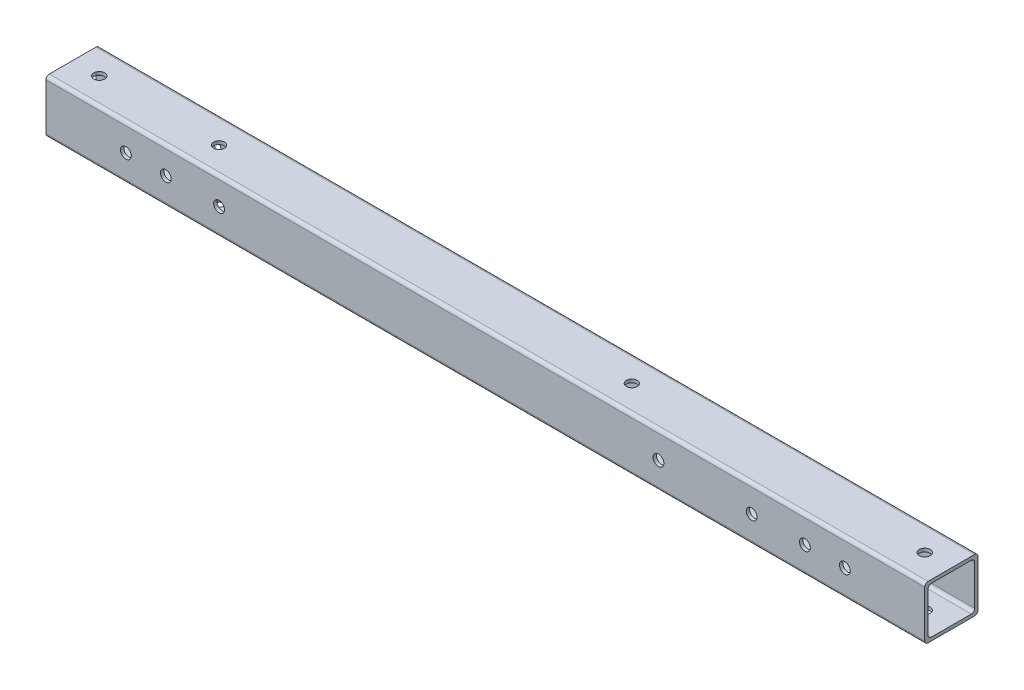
from build123d import *

# Parameters (mm, degrees)
SKETCH1_W          = 1676.4
SKETCH1_H          = 101.6
EXTRUDE1_DEPTH     = 101.6
CUT_EXTRUDE1_REACH = 1684.546
SKETCH2_W          = 88.9
SKETCH2_H          = 88.9
SKETCH3_R          = 10.31875
CUT_EXTRUDE2_DEPTH = 1683.546308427
FILLET1_R          = 6.35
SKETCH4_R          = 10.31875
CUT_EXTRUDE3_DEPTH = 101.6
SKETCH5_R          = 10.31875
CUT_EXTRUDE4_DEPTH = 101.6
SKETCH6_R          = 10.31875
CUT_EXTRUDE5_DEPTH = 101.6
SKETCH7_R          = 10.31875
CUT_EXTRUDE6_DEPTH = 101.6
SKETCH8_R          = 10.31875
CUT_EXTRUDE7_DEPTH = 101.6


with BuildPart() as part:
    # Sketch1 → Extrude1 (new body)
    with BuildSketch(Plane(origin=(0, 0, 0), x_dir=(1, 0, 0), z_dir=(0, 1, 0))):
        with Locations((-838.2, -50.8)):
            Rectangle(SKETCH1_W, SKETCH1_H)
    extrude(amount=EXTRUDE1_DEPTH)

    # Sketch2 → Cut-Extrude1 (cut, up to next)
    with BuildSketch(Plane.ZY.offset(1676.4), mode=Mode.PRIVATE) as cut_extrude1_sk1:
        with Locations((50.8, 50.8)):
            Rectangle(SKETCH2_W, SKETCH2_H)
    cut_extrude1_tool1 = extrude(cut_extrude1_sk1.sketch, amount=-CUT_EXTRUDE1_REACH, mode=Mode.PRIVATE) & part.part
    add(cut_extrude1_tool1.solids().sort_by_distance((-1676.4, 50.8, 50.8))[0], mode=Mode.SUBTRACT)

    # Sketch3 → Cut-Extrude2 (cut, through all)
    with BuildSketch(Plane(origin=(0, 101.6, 0), x_dir=(1, 0, 0), z_dir=(0, 1, 0))):
        with Locations(Location((-1625.6, -50.8, 0), (0, 0, 270))):
            Circle(SKETCH3_R)
    cut_extrude2 = extrude(amount=-CUT_EXTRUDE2_DEPTH, mode=Mode.SUBTRACT)

    # Fillet1
    fillet1_edges = [part.edges().sort_by_distance(p)[0] for p in [
        (-838.2, 101.6, 101.6),
        (-838.2, 6.35, 6.35),
        (-838.2, 95.25, 6.35),
        (-838.2, 95.25, 95.25),
        (-838.2, 6.35, 95.25),
        (-838.2, 0, 101.6),
        (-838.2, 0, 0),
        (-838.2, 101.6, 0),
    ]]
    fillet(fillet1_edges, radius=FILLET1_R)

    # Sketch4 → Cut-Extrude3 (cut)
    with BuildSketch(Plane.XY):
        with Locations(Location((-1524, 50.8, 0), (0, 0, 270))):
            Circle(SKETCH4_R)
    cut_extrude3 = extrude(amount=CUT_EXTRUDE3_DEPTH, mode=Mode.SUBTRACT)

    # Sketch5 → Cut-Extrude4 (cut)
    with BuildSketch(Plane(origin=(0, 0, 0), x_dir=(-1, 0, 0), z_dir=(0, 0, -1))):
        with Locations((1447.8, 50.8)):
            Circle(SKETCH5_R)
        with Locations((1346.2, 50.8)):
            Circle(SKETCH5_R)
    cut_extrude4 = extrude(amount=-CUT_EXTRUDE4_DEPTH, mode=Mode.SUBTRACT)

    # Mirror1: Cut-Extrude2, Cut-Extrude3, Cut-Extrude4 across plane
    add(cut_extrude2.mirror(Plane(origin=(-838.2, 0, 0), x_dir=(0, 0, 1), z_dir=(1, 0, 0))), mode=Mode.SUBTRACT)
    add(cut_extrude3.mirror(Plane(origin=(-838.2, 0, 0), x_dir=(0, 0, 1), z_dir=(1, 0, 0))), mode=Mode.SUBTRACT)
    add(cut_extrude4.mirror(Plane(origin=(-838.2, 0, 0), x_dir=(0, 0, 1), z_dir=(1, 0, 0))), mode=Mode.SUBTRACT)

    # Sketch6 → Cut-Extrude5 (cut)
    with BuildSketch(Plane(origin=(0, 101.6, 0), x_dir=(1, 0, 0), z_dir=(0, 1, 0))):
        with Locations(Location((-609.6, -50.8, 0), (0, 0, 270))):
            Circle(SKETCH6_R)
    extrude(amount=-CUT_EXTRUDE5_DEPTH, mode=Mode.SUBTRACT)

    # Sketch7 → Cut-Extrude6 (cut)
    with BuildSketch(Plane(origin=(0, 0, 0), x_dir=(-1, 0, 0), z_dir=(0, 0, -1))):
        with Locations((508, 50.8)):
            Circle(SKETCH7_R)
    extrude(amount=-CUT_EXTRUDE6_DEPTH, mode=Mode.SUBTRACT)

    # Sketch8 → Cut-Extrude7 (cut)
    with BuildSketch(Plane(origin=(0, 101.6, 0), x_dir=(1, 0, 0), z_dir=(0, 1, 0))):
        with Locations(Location((-1397, -50.8, 0), (0, 0, 270))):
            Circle(SKETCH8_R)
    extrude(amount=-CUT_EXTRUDE7_DEPTH, mode=Mode.SUBTRACT)


solid = part.part
